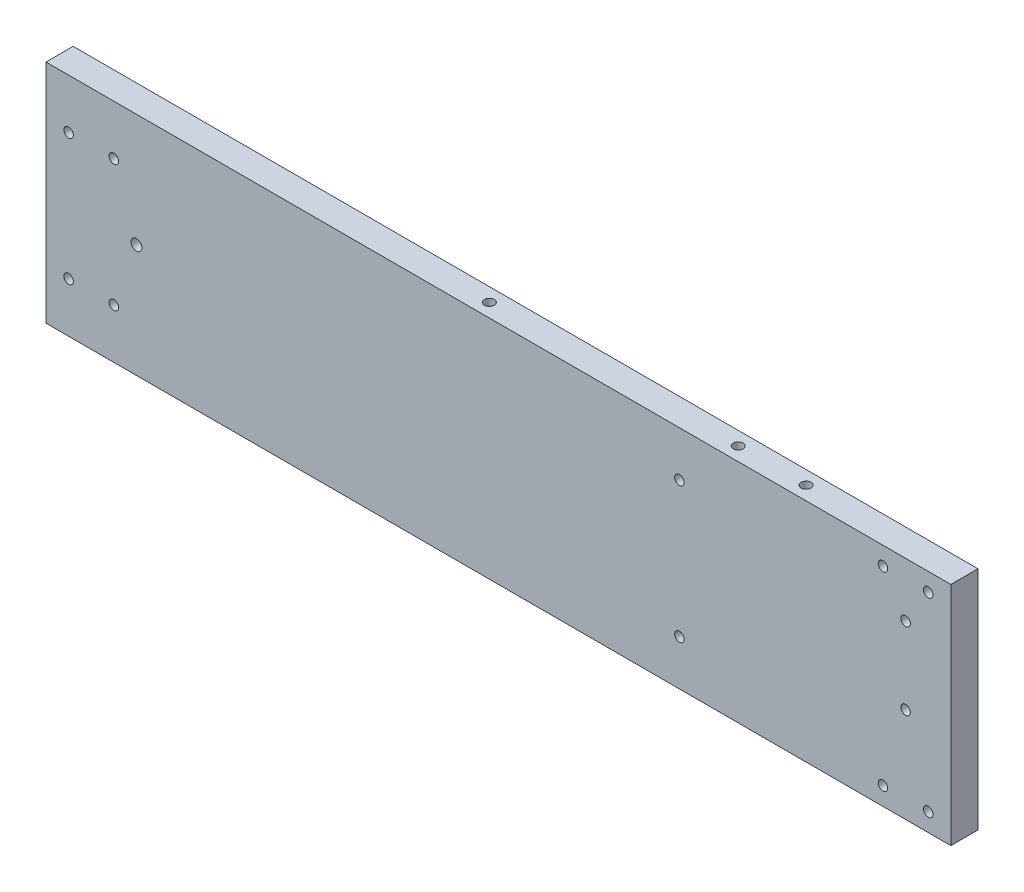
ISO-10303-21;
HEADER;
FILE_DESCRIPTION(('STEP AP214'),'2;1');
FILE_NAME('part.step','',(''),(''),'','','');
FILE_SCHEMA(('AUTOMOTIVE_DESIGN { 1 0 10303 214 1 1 1 1 }'));
ENDSEC;
DATA;
#1=APPLICATION_CONTEXT('core data for automotive mechanical design processes');
#2=APPLICATION_PROTOCOL_DEFINITION('international standard','automotive_design',2000,#1);
#3=PRODUCT_CONTEXT('',#1,'mechanical');
#4=PRODUCT('Part','Part','',(#3));
#5=PRODUCT_RELATED_PRODUCT_CATEGORY('part','',(#4));
#6=PRODUCT_DEFINITION_FORMATION('','',#4);
#7=PRODUCT_DEFINITION_CONTEXT('part definition',#1,'design');
#8=PRODUCT_DEFINITION('design','',#6,#7);
#9=PRODUCT_DEFINITION_SHAPE('','',#8);
#10=(LENGTH_UNIT() NAMED_UNIT(*) SI_UNIT(.MILLI.,.METRE.));
#11=(NAMED_UNIT(*) PLANE_ANGLE_UNIT() SI_UNIT($,.RADIAN.));
#12=(NAMED_UNIT(*) SI_UNIT($,.STERADIAN.) SOLID_ANGLE_UNIT());
#13=UNCERTAINTY_MEASURE_WITH_UNIT(LENGTH_MEASURE(1.E-05),#10,'distance_accuracy_value','');
#14=(GEOMETRIC_REPRESENTATION_CONTEXT(3) GLOBAL_UNCERTAINTY_ASSIGNED_CONTEXT((#13)) GLOBAL_UNIT_ASSIGNED_CONTEXT((#10,
#11,#12)) REPRESENTATION_CONTEXT('',''));
#15=CARTESIAN_POINT('',(0.,0.,0.));
#16=DIRECTION('',(0.,0.,1.));
#17=DIRECTION('',(1.,0.,0.));
#18=AXIS2_PLACEMENT_3D('',#15,#16,#17);
#19=CARTESIAN_POINT('',(-200.,25.,-6.));
#20=DIRECTION('',(-1.,0.,0.));
#21=DIRECTION('',(0.,0.,1.));
#22=AXIS2_PLACEMENT_3D('',#19,#20,#21);
#23=PLANE('',#22);
#24=DIRECTION('',(0.,-1.,0.));
#25=VECTOR('',#24,1.);
#26=CARTESIAN_POINT('',(-200.,25.,0.));
#27=LINE('',#26,#25);
#28=CARTESIAN_POINT('',(-200.,25.,0.));
#29=VERTEX_POINT('',#28);
#30=CARTESIAN_POINT('',(-200.,-25.,0.));
#31=VERTEX_POINT('',#30);
#32=EDGE_CURVE('E71',#29,#31,#27,.T.);
#33=ORIENTED_EDGE('',*,*,#32,.F.);
#34=DIRECTION('',(0.,0.,1.));
#35=VECTOR('',#34,1.);
#36=CARTESIAN_POINT('',(-200.,25.,-6.));
#37=LINE('',#36,#35);
#38=CARTESIAN_POINT('',(-200.,25.,-6.));
#39=VERTEX_POINT('',#38);
#40=EDGE_CURVE('E11',#39,#29,#37,.T.);
#41=ORIENTED_EDGE('',*,*,#40,.F.);
#42=DIRECTION('',(0.,-1.,0.));
#43=VECTOR('',#42,1.);
#44=CARTESIAN_POINT('',(-200.,25.,-6.));
#45=LINE('',#44,#43);
#46=CARTESIAN_POINT('',(-200.,-25.,-6.));
#47=VERTEX_POINT('',#46);
#48=EDGE_CURVE('E73',#39,#47,#45,.T.);
#49=ORIENTED_EDGE('',*,*,#48,.T.);
#50=DIRECTION('',(0.,0.,1.));
#51=VECTOR('',#50,1.);
#52=CARTESIAN_POINT('',(-200.,-25.,-6.));
#53=LINE('',#52,#51);
#54=EDGE_CURVE('E34',#47,#31,#53,.T.);
#55=ORIENTED_EDGE('',*,*,#54,.T.);
#56=EDGE_LOOP('',(#33,#41,#49,#55));
#57=FACE_BOUND('',#56,.T.);
#58=ADVANCED_FACE('F31',(#57),#23,.T.);
#59=CARTESIAN_POINT('',(-200.,25.,-6.));
#60=DIRECTION('',(0.,1.,0.));
#61=DIRECTION('',(0.,0.,1.));
#62=AXIS2_PLACEMENT_3D('',#59,#60,#61);
#63=PLANE('',#62);
#64=CARTESIAN_POINT('',(-50.,25.,-3.));
#65=DIRECTION('',(0.,1.,0.));
#66=DIRECTION('',(0.,0.,1.));
#67=AXIS2_PLACEMENT_3D('',#64,#65,#66);
#68=CIRCLE('',#67,1.10000000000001);
#69=CARTESIAN_POINT('',(-50.,25.,-1.9));
#70=VERTEX_POINT('',#69);
#71=EDGE_CURVE('E141',#70,#70,#68,.T.);
#72=ORIENTED_EDGE('',*,*,#71,.F.);
#73=EDGE_LOOP('',(#72));
#74=FACE_BOUND('',#73,.T.);
#75=CARTESIAN_POINT('',(-105.,25.,-3.));
#76=DIRECTION('',(0.,1.,0.));
#77=DIRECTION('',(0.,0.,1.));
#78=AXIS2_PLACEMENT_3D('',#75,#76,#77);
#79=CIRCLE('',#78,1.10000000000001);
#80=CARTESIAN_POINT('',(-105.,25.,-1.9));
#81=VERTEX_POINT('',#80);
#82=EDGE_CURVE('E145',#81,#81,#79,.T.);
#83=ORIENTED_EDGE('',*,*,#82,.F.);
#84=EDGE_LOOP('',(#83));
#85=FACE_BOUND('',#84,.T.);
#86=CARTESIAN_POINT('',(-35.,25.,-3.));
#87=DIRECTION('',(0.,1.,0.));
#88=DIRECTION('',(0.,0.,1.));
#89=AXIS2_PLACEMENT_3D('',#86,#87,#88);
#90=CIRCLE('',#89,1.1);
#91=CARTESIAN_POINT('',(-35.,25.,-1.9));
#92=VERTEX_POINT('',#91);
#93=EDGE_CURVE('E148',#92,#92,#90,.T.);
#94=ORIENTED_EDGE('',*,*,#93,.F.);
#95=EDGE_LOOP('',(#94));
#96=FACE_BOUND('',#95,.T.);
#97=DIRECTION('',(-1.,0.,0.));
#98=VECTOR('',#97,1.);
#99=CARTESIAN_POINT('',(-200.,25.,0.));
#100=LINE('',#99,#98);
#101=CARTESIAN_POINT('',(0.,25.,0.));
#102=VERTEX_POINT('',#101);
#103=EDGE_CURVE('E88',#102,#29,#100,.T.);
#104=ORIENTED_EDGE('',*,*,#103,.F.);
#105=DIRECTION('',(0.,0.,1.));
#106=VECTOR('',#105,1.);
#107=CARTESIAN_POINT('',(0.,25.,-6.));
#108=LINE('',#107,#106);
#109=CARTESIAN_POINT('',(0.,25.,-6.));
#110=VERTEX_POINT('',#109);
#111=EDGE_CURVE('E39',#110,#102,#108,.T.);
#112=ORIENTED_EDGE('',*,*,#111,.F.);
#113=DIRECTION('',(-1.,0.,0.));
#114=VECTOR('',#113,1.);
#115=CARTESIAN_POINT('',(-200.,25.,-6.));
#116=LINE('',#115,#114);
#117=EDGE_CURVE('E78',#110,#39,#116,.T.);
#118=ORIENTED_EDGE('',*,*,#117,.T.);
#119=ORIENTED_EDGE('',*,*,#40,.T.);
#120=EDGE_LOOP('',(#104,#112,#118,#119));
#121=FACE_BOUND('',#120,.T.);
#122=ADVANCED_FACE('F108',(#74,#85,#96,#121),#63,.T.);
#123=CARTESIAN_POINT('',(0.,25.,-6.));
#124=DIRECTION('',(1.,0.,0.));
#125=DIRECTION('',(0.,0.,-1.));
#126=AXIS2_PLACEMENT_3D('',#123,#124,#125);
#127=PLANE('',#126);
#128=DIRECTION('',(0.,1.,0.));
#129=VECTOR('',#128,1.);
#130=CARTESIAN_POINT('',(0.,25.,0.));
#131=LINE('',#130,#129);
#132=CARTESIAN_POINT('',(0.,-25.,0.));
#133=VERTEX_POINT('',#132);
#134=EDGE_CURVE('E85',#133,#102,#131,.T.);
#135=ORIENTED_EDGE('',*,*,#134,.F.);
#136=DIRECTION('',(0.,0.,1.));
#137=VECTOR('',#136,1.);
#138=CARTESIAN_POINT('',(0.,-25.,-6.));
#139=LINE('',#138,#137);
#140=CARTESIAN_POINT('',(0.,-25.,-6.));
#141=VERTEX_POINT('',#140);
#142=EDGE_CURVE('E77',#141,#133,#139,.T.);
#143=ORIENTED_EDGE('',*,*,#142,.F.);
#144=DIRECTION('',(0.,1.,0.));
#145=VECTOR('',#144,1.);
#146=CARTESIAN_POINT('',(0.,25.,-6.));
#147=LINE('',#146,#145);
#148=EDGE_CURVE('E101',#141,#110,#147,.T.);
#149=ORIENTED_EDGE('',*,*,#148,.T.);
#150=ORIENTED_EDGE('',*,*,#111,.T.);
#151=EDGE_LOOP('',(#135,#143,#149,#150));
#152=FACE_BOUND('',#151,.T.);
#153=ADVANCED_FACE('F105',(#152),#127,.T.);
#154=CARTESIAN_POINT('',(-200.,-25.,-6.));
#155=DIRECTION('',(0.,-1.,0.));
#156=DIRECTION('',(0.,0.,-1.));
#157=AXIS2_PLACEMENT_3D('',#154,#155,#156);
#158=PLANE('',#157);
#159=CARTESIAN_POINT('',(-50.,-25.,-3.2551345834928));
#160=DIRECTION('',(0.,-1.,0.));
#161=DIRECTION('',(0.,0.,-1.));
#162=AXIS2_PLACEMENT_3D('',#159,#160,#161);
#163=CIRCLE('',#162,1.10000000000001);
#164=CARTESIAN_POINT('',(-50.,-25.,-4.35513458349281));
#165=VERTEX_POINT('',#164);
#166=EDGE_CURVE('E154',#165,#165,#163,.T.);
#167=ORIENTED_EDGE('',*,*,#166,.F.);
#168=EDGE_LOOP('',(#167));
#169=FACE_BOUND('',#168,.T.);
#170=CARTESIAN_POINT('',(-105.,-25.,-3.2551345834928));
#171=DIRECTION('',(0.,-1.,0.));
#172=DIRECTION('',(0.,0.,-1.));
#173=AXIS2_PLACEMENT_3D('',#170,#171,#172);
#174=CIRCLE('',#173,1.10000000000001);
#175=CARTESIAN_POINT('',(-105.,-25.,-4.35513458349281));
#176=VERTEX_POINT('',#175);
#177=EDGE_CURVE('E165',#176,#176,#174,.T.);
#178=ORIENTED_EDGE('',*,*,#177,.F.);
#179=EDGE_LOOP('',(#178));
#180=FACE_BOUND('',#179,.T.);
#181=CARTESIAN_POINT('',(-30.,-25.,-3.2551345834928));
#182=DIRECTION('',(0.,-1.,0.));
#183=DIRECTION('',(0.,0.,-1.));
#184=AXIS2_PLACEMENT_3D('',#181,#182,#183);
#185=CIRCLE('',#184,1.1);
#186=CARTESIAN_POINT('',(-30.,-25.,-4.3551345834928));
#187=VERTEX_POINT('',#186);
#188=EDGE_CURVE('E171',#187,#187,#185,.T.);
#189=ORIENTED_EDGE('',*,*,#188,.F.);
#190=EDGE_LOOP('',(#189));
#191=FACE_BOUND('',#190,.T.);
#192=DIRECTION('',(1.,0.,0.));
#193=VECTOR('',#192,1.);
#194=CARTESIAN_POINT('',(-200.,-25.,0.));
#195=LINE('',#194,#193);
#196=EDGE_CURVE('E80',#31,#133,#195,.T.);
#197=ORIENTED_EDGE('',*,*,#196,.F.);
#198=ORIENTED_EDGE('',*,*,#54,.F.);
#199=DIRECTION('',(1.,0.,0.));
#200=VECTOR('',#199,1.);
#201=CARTESIAN_POINT('',(-200.,-25.,-6.));
#202=LINE('',#201,#200);
#203=EDGE_CURVE('E99',#47,#141,#202,.T.);
#204=ORIENTED_EDGE('',*,*,#203,.T.);
#205=ORIENTED_EDGE('',*,*,#142,.T.);
#206=EDGE_LOOP('',(#197,#198,#204,#205));
#207=FACE_BOUND('',#206,.T.);
#208=ADVANCED_FACE('F81',(#169,#180,#191,#207),#158,.T.);
#209=CARTESIAN_POINT('',(-200.,-25.,-6.));
#210=DIRECTION('',(0.,0.,1.));
#211=DIRECTION('',(1.,0.,0.));
#212=AXIS2_PLACEMENT_3D('',#209,#210,#211);
#213=PLANE('',#212);
#214=CARTESIAN_POINT('',(-195.,-14.,-6.));
#215=DIRECTION('',(0.,0.,1.));
#216=DIRECTION('',(-1.,0.,0.));
#217=AXIS2_PLACEMENT_3D('',#214,#215,#216);
#218=CIRCLE('',#217,1.04999999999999);
#219=CARTESIAN_POINT('',(-196.05,-14.,-6.));
#220=VERTEX_POINT('',#219);
#221=EDGE_CURVE('E365',#220,#220,#218,.T.);
#222=ORIENTED_EDGE('',*,*,#221,.T.);
#223=EDGE_LOOP('',(#222));
#224=FACE_BOUND('',#223,.T.);
#225=CARTESIAN_POINT('',(-185.,-14.,-6.));
#226=DIRECTION('',(0.,0.,1.));
#227=DIRECTION('',(-1.,0.,0.));
#228=AXIS2_PLACEMENT_3D('',#225,#226,#227);
#229=CIRCLE('',#228,1.04999999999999);
#230=CARTESIAN_POINT('',(-186.05,-14.,-6.));
#231=VERTEX_POINT('',#230);
#232=EDGE_CURVE('E374',#231,#231,#229,.T.);
#233=ORIENTED_EDGE('',*,*,#232,.T.);
#234=EDGE_LOOP('',(#233));
#235=FACE_BOUND('',#234,.T.);
#236=CARTESIAN_POINT('',(-185.,14.,-6.));
#237=DIRECTION('',(0.,0.,1.));
#238=DIRECTION('',(1.,0.,0.));
#239=AXIS2_PLACEMENT_3D('',#236,#237,#238);
#240=CIRCLE('',#239,1.04999999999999);
#241=CARTESIAN_POINT('',(-183.95,14.,-6.));
#242=VERTEX_POINT('',#241);
#243=EDGE_CURVE('E380',#242,#242,#240,.T.);
#244=ORIENTED_EDGE('',*,*,#243,.T.);
#245=EDGE_LOOP('',(#244));
#246=FACE_BOUND('',#245,.T.);
#247=CARTESIAN_POINT('',(-195.,14.,-6.));
#248=DIRECTION('',(0.,0.,1.));
#249=DIRECTION('',(1.,0.,0.));
#250=AXIS2_PLACEMENT_3D('',#247,#248,#249);
#251=CIRCLE('',#250,1.04999999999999);
#252=CARTESIAN_POINT('',(-193.95,14.,-6.));
#253=VERTEX_POINT('',#252);
#254=EDGE_CURVE('E386',#253,#253,#251,.T.);
#255=ORIENTED_EDGE('',*,*,#254,.T.);
#256=EDGE_LOOP('',(#255));
#257=FACE_BOUND('',#256,.T.);
#258=ORIENTED_EDGE('',*,*,#48,.F.);
#259=ORIENTED_EDGE('',*,*,#117,.F.);
#260=ORIENTED_EDGE('',*,*,#148,.F.);
#261=ORIENTED_EDGE('',*,*,#203,.F.);
#262=EDGE_LOOP('',(#258,#259,#260,#261));
#263=FACE_BOUND('',#262,.T.);
#264=ADVANCED_FACE('F110',(#224,#235,#246,#257,#263),#213,.F.);
#265=CARTESIAN_POINT('',(-200.,-25.,0.));
#266=DIRECTION('',(0.,0.,1.));
#267=DIRECTION('',(1.,0.,0.));
#268=AXIS2_PLACEMENT_3D('',#265,#266,#267);
#269=PLANE('',#268);
#270=CARTESIAN_POINT('',(-180.,0.,0.));
#271=DIRECTION('',(0.,0.,1.));
#272=DIRECTION('',(1.,0.,0.));
#273=AXIS2_PLACEMENT_3D('',#270,#271,#272);
#274=CIRCLE('',#273,1.20000000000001);
#275=CARTESIAN_POINT('',(-178.8,0.,0.));
#276=VERTEX_POINT('',#275);
#277=EDGE_CURVE('E362',#276,#276,#274,.T.);
#278=ORIENTED_EDGE('',*,*,#277,.F.);
#279=EDGE_LOOP('',(#278));
#280=FACE_BOUND('',#279,.T.);
#281=CARTESIAN_POINT('',(-195.,-14.,0.));
#282=DIRECTION('',(0.,0.,1.));
#283=DIRECTION('',(-1.,0.,0.));
#284=AXIS2_PLACEMENT_3D('',#281,#282,#283);
#285=CIRCLE('',#284,1.04999999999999);
#286=CARTESIAN_POINT('',(-196.05,-14.,0.));
#287=VERTEX_POINT('',#286);
#288=EDGE_CURVE('E361',#287,#287,#285,.T.);
#289=ORIENTED_EDGE('',*,*,#288,.F.);
#290=EDGE_LOOP('',(#289));
#291=FACE_BOUND('',#290,.T.);
#292=CARTESIAN_POINT('',(-185.,-14.,0.));
#293=DIRECTION('',(0.,0.,1.));
#294=DIRECTION('',(-1.,0.,0.));
#295=AXIS2_PLACEMENT_3D('',#292,#293,#294);
#296=CIRCLE('',#295,1.04999999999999);
#297=CARTESIAN_POINT('',(-186.05,-14.,0.));
#298=VERTEX_POINT('',#297);
#299=EDGE_CURVE('E371',#298,#298,#296,.T.);
#300=ORIENTED_EDGE('',*,*,#299,.F.);
#301=EDGE_LOOP('',(#300));
#302=FACE_BOUND('',#301,.T.);
#303=CARTESIAN_POINT('',(-185.,14.,0.));
#304=DIRECTION('',(0.,0.,1.));
#305=DIRECTION('',(1.,0.,0.));
#306=AXIS2_PLACEMENT_3D('',#303,#304,#305);
#307=CIRCLE('',#306,1.04999999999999);
#308=CARTESIAN_POINT('',(-183.95,14.,0.));
#309=VERTEX_POINT('',#308);
#310=EDGE_CURVE('E377',#309,#309,#307,.T.);
#311=ORIENTED_EDGE('',*,*,#310,.F.);
#312=EDGE_LOOP('',(#311));
#313=FACE_BOUND('',#312,.T.);
#314=CARTESIAN_POINT('',(-195.,14.,0.));
#315=DIRECTION('',(0.,0.,1.));
#316=DIRECTION('',(1.,0.,0.));
#317=AXIS2_PLACEMENT_3D('',#314,#315,#316);
#318=CIRCLE('',#317,1.04999999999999);
#319=CARTESIAN_POINT('',(-193.95,14.,0.));
#320=VERTEX_POINT('',#319);
#321=EDGE_CURVE('E383',#320,#320,#318,.T.);
#322=ORIENTED_EDGE('',*,*,#321,.F.);
#323=EDGE_LOOP('',(#322));
#324=FACE_BOUND('',#323,.T.);
#325=CARTESIAN_POINT('',(-10.,-4.,0.));
#326=DIRECTION('',(0.,0.,1.));
#327=DIRECTION('',(1.,0.,0.));
#328=AXIS2_PLACEMENT_3D('',#325,#326,#327);
#329=CIRCLE('',#328,1.05);
#330=CARTESIAN_POINT('',(-8.95,-4.,0.));
#331=VERTEX_POINT('',#330);
#332=EDGE_CURVE('E177',#331,#331,#329,.T.);
#333=ORIENTED_EDGE('',*,*,#332,.F.);
#334=EDGE_LOOP('',(#333));
#335=FACE_BOUND('',#334,.T.);
#336=CARTESIAN_POINT('',(-10.,13.,0.));
#337=DIRECTION('',(0.,0.,1.));
#338=DIRECTION('',(1.,0.,0.));
#339=AXIS2_PLACEMENT_3D('',#336,#337,#338);
#340=CIRCLE('',#339,1.05);
#341=CARTESIAN_POINT('',(-8.95,13.,0.));
#342=VERTEX_POINT('',#341);
#343=EDGE_CURVE('E183',#342,#342,#340,.T.);
#344=ORIENTED_EDGE('',*,*,#343,.F.);
#345=EDGE_LOOP('',(#344));
#346=FACE_BOUND('',#345,.T.);
#347=CARTESIAN_POINT('',(-60.,-15.,0.));
#348=DIRECTION('',(0.,0.,1.));
#349=DIRECTION('',(1.,0.,0.));
#350=AXIS2_PLACEMENT_3D('',#347,#348,#349);
#351=CIRCLE('',#350,1.04999999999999);
#352=CARTESIAN_POINT('',(-58.95,-15.,0.));
#353=VERTEX_POINT('',#352);
#354=EDGE_CURVE('E189',#353,#353,#351,.T.);
#355=ORIENTED_EDGE('',*,*,#354,.F.);
#356=EDGE_LOOP('',(#355));
#357=FACE_BOUND('',#356,.T.);
#358=CARTESIAN_POINT('',(-60.,15.,0.));
#359=DIRECTION('',(0.,0.,1.));
#360=DIRECTION('',(1.,0.,0.));
#361=AXIS2_PLACEMENT_3D('',#358,#359,#360);
#362=CIRCLE('',#361,1.05);
#363=CARTESIAN_POINT('',(-58.95,15.,0.));
#364=VERTEX_POINT('',#363);
#365=EDGE_CURVE('E195',#364,#364,#362,.T.);
#366=ORIENTED_EDGE('',*,*,#365,.F.);
#367=EDGE_LOOP('',(#366));
#368=FACE_BOUND('',#367,.T.);
#369=CARTESIAN_POINT('',(-15.,-21.,0.));
#370=DIRECTION('',(0.,0.,1.));
#371=DIRECTION('',(-1.,0.,0.));
#372=AXIS2_PLACEMENT_3D('',#369,#370,#371);
#373=CIRCLE('',#372,1.05);
#374=CARTESIAN_POINT('',(-16.05,-21.,0.));
#375=VERTEX_POINT('',#374);
#376=EDGE_CURVE('E201',#375,#375,#373,.T.);
#377=ORIENTED_EDGE('',*,*,#376,.F.);
#378=EDGE_LOOP('',(#377));
#379=FACE_BOUND('',#378,.T.);
#380=CARTESIAN_POINT('',(-5.,-21.,0.));
#381=DIRECTION('',(0.,0.,1.));
#382=DIRECTION('',(-1.,0.,0.));
#383=AXIS2_PLACEMENT_3D('',#380,#381,#382);
#384=CIRCLE('',#383,1.05);
#385=CARTESIAN_POINT('',(-6.05,-21.,0.));
#386=VERTEX_POINT('',#385);
#387=EDGE_CURVE('E207',#386,#386,#384,.T.);
#388=ORIENTED_EDGE('',*,*,#387,.F.);
#389=EDGE_LOOP('',(#388));
#390=FACE_BOUND('',#389,.T.);
#391=CARTESIAN_POINT('',(-15.,21.,0.));
#392=DIRECTION('',(0.,0.,1.));
#393=DIRECTION('',(1.,0.,0.));
#394=AXIS2_PLACEMENT_3D('',#391,#392,#393);
#395=CIRCLE('',#394,1.05);
#396=CARTESIAN_POINT('',(-13.95,21.,0.));
#397=VERTEX_POINT('',#396);
#398=EDGE_CURVE('E213',#397,#397,#395,.T.);
#399=ORIENTED_EDGE('',*,*,#398,.F.);
#400=EDGE_LOOP('',(#399));
#401=FACE_BOUND('',#400,.T.);
#402=CARTESIAN_POINT('',(-5.,21.,0.));
#403=DIRECTION('',(0.,0.,1.));
#404=DIRECTION('',(1.,0.,0.));
#405=AXIS2_PLACEMENT_3D('',#402,#403,#404);
#406=CIRCLE('',#405,1.05);
#407=CARTESIAN_POINT('',(-3.95,21.,0.));
#408=VERTEX_POINT('',#407);
#409=EDGE_CURVE('E92',#408,#408,#406,.T.);
#410=ORIENTED_EDGE('',*,*,#409,.F.);
#411=EDGE_LOOP('',(#410));
#412=FACE_BOUND('',#411,.T.);
#413=ORIENTED_EDGE('',*,*,#32,.T.);
#414=ORIENTED_EDGE('',*,*,#196,.T.);
#415=ORIENTED_EDGE('',*,*,#134,.T.);
#416=ORIENTED_EDGE('',*,*,#103,.T.);
#417=EDGE_LOOP('',(#413,#414,#415,#416));
#418=FACE_BOUND('',#417,.T.);
#419=ADVANCED_FACE('F87',(#280,#291,#302,#313,#324,#335,#346,#357,#368,#379,#390,#401,#412,
#418),#269,.T.);
#420=CARTESIAN_POINT('',(-5.,21.,-2.));
#421=DIRECTION('',(0.,0.,1.));
#422=DIRECTION('',(1.,0.,0.));
#423=AXIS2_PLACEMENT_3D('',#420,#421,#422);
#424=CYLINDRICAL_SURFACE('',#423,1.05);
#425=CARTESIAN_POINT('',(-5.,21.,-2.));
#426=DIRECTION('',(0.,0.,1.));
#427=DIRECTION('',(1.,0.,0.));
#428=AXIS2_PLACEMENT_3D('',#425,#426,#427);
#429=CIRCLE('',#428,1.05);
#430=CARTESIAN_POINT('',(-3.95,21.,-2.));
#431=VERTEX_POINT('',#430);
#432=EDGE_CURVE('E89',#431,#431,#429,.T.);
#433=ORIENTED_EDGE('',*,*,#432,.F.);
#434=EDGE_LOOP('',(#433));
#435=FACE_BOUND('',#434,.T.);
#436=ORIENTED_EDGE('',*,*,#409,.T.);
#437=EDGE_LOOP('',(#436));
#438=FACE_BOUND('',#437,.T.);
#439=ADVANCED_FACE('F119',(#435,#438),#424,.F.);
#440=CARTESIAN_POINT('',(-5.,21.,-2.));
#441=DIRECTION('',(0.,0.,1.));
#442=DIRECTION('',(1.,0.,0.));
#443=AXIS2_PLACEMENT_3D('',#440,#441,#442);
#444=PLANE('',#443);
#445=ORIENTED_EDGE('',*,*,#432,.T.);
#446=EDGE_LOOP('',(#445));
#447=FACE_BOUND('',#446,.T.);
#448=ADVANCED_FACE('F223',(#447),#444,.T.);
#449=CARTESIAN_POINT('',(-15.,21.,-2.));
#450=DIRECTION('',(0.,0.,1.));
#451=DIRECTION('',(1.,0.,0.));
#452=AXIS2_PLACEMENT_3D('',#449,#450,#451);
#453=CYLINDRICAL_SURFACE('',#452,1.05);
#454=CARTESIAN_POINT('',(-15.,21.,-2.));
#455=DIRECTION('',(0.,0.,1.));
#456=DIRECTION('',(1.,0.,0.));
#457=AXIS2_PLACEMENT_3D('',#454,#455,#456);
#458=CIRCLE('',#457,1.05);
#459=CARTESIAN_POINT('',(-13.95,21.,-2.));
#460=VERTEX_POINT('',#459);
#461=EDGE_CURVE('E216',#460,#460,#458,.T.);
#462=ORIENTED_EDGE('',*,*,#461,.F.);
#463=EDGE_LOOP('',(#462));
#464=FACE_BOUND('',#463,.T.);
#465=ORIENTED_EDGE('',*,*,#398,.T.);
#466=EDGE_LOOP('',(#465));
#467=FACE_BOUND('',#466,.T.);
#468=ADVANCED_FACE('F229',(#464,#467),#453,.F.);
#469=CARTESIAN_POINT('',(-15.,21.,-2.));
#470=DIRECTION('',(0.,0.,1.));
#471=DIRECTION('',(1.,0.,0.));
#472=AXIS2_PLACEMENT_3D('',#469,#470,#471);
#473=PLANE('',#472);
#474=ORIENTED_EDGE('',*,*,#461,.T.);
#475=EDGE_LOOP('',(#474));
#476=FACE_BOUND('',#475,.T.);
#477=ADVANCED_FACE('F236',(#476),#473,.T.);
#478=CARTESIAN_POINT('',(-5.,-21.,-2.));
#479=DIRECTION('',(0.,0.,1.));
#480=DIRECTION('',(1.,0.,0.));
#481=AXIS2_PLACEMENT_3D('',#478,#479,#480);
#482=CYLINDRICAL_SURFACE('',#481,1.05);
#483=CARTESIAN_POINT('',(-5.,-21.,-2.));
#484=DIRECTION('',(0.,0.,1.));
#485=DIRECTION('',(-1.,0.,0.));
#486=AXIS2_PLACEMENT_3D('',#483,#484,#485);
#487=CIRCLE('',#486,1.05);
#488=CARTESIAN_POINT('',(-6.05,-21.,-2.));
#489=VERTEX_POINT('',#488);
#490=EDGE_CURVE('E210',#489,#489,#487,.T.);
#491=ORIENTED_EDGE('',*,*,#490,.F.);
#492=EDGE_LOOP('',(#491));
#493=FACE_BOUND('',#492,.T.);
#494=ORIENTED_EDGE('',*,*,#387,.T.);
#495=EDGE_LOOP('',(#494));
#496=FACE_BOUND('',#495,.T.);
#497=ADVANCED_FACE('F240',(#493,#496),#482,.F.);
#498=CARTESIAN_POINT('',(-5.,-21.,-2.));
#499=DIRECTION('',(0.,0.,-1.));
#500=DIRECTION('',(-1.,0.,0.));
#501=AXIS2_PLACEMENT_3D('',#498,#499,#500);
#502=PLANE('',#501);
#503=ORIENTED_EDGE('',*,*,#490,.T.);
#504=EDGE_LOOP('',(#503));
#505=FACE_BOUND('',#504,.T.);
#506=ADVANCED_FACE('F244',(#505),#502,.F.);
#507=CARTESIAN_POINT('',(-15.,-21.,-2.));
#508=DIRECTION('',(0.,0.,1.));
#509=DIRECTION('',(1.,0.,0.));
#510=AXIS2_PLACEMENT_3D('',#507,#508,#509);
#511=CYLINDRICAL_SURFACE('',#510,1.05);
#512=CARTESIAN_POINT('',(-15.,-21.,-2.));
#513=DIRECTION('',(0.,0.,1.));
#514=DIRECTION('',(-1.,0.,0.));
#515=AXIS2_PLACEMENT_3D('',#512,#513,#514);
#516=CIRCLE('',#515,1.05);
#517=CARTESIAN_POINT('',(-16.05,-21.,-2.));
#518=VERTEX_POINT('',#517);
#519=EDGE_CURVE('E204',#518,#518,#516,.T.);
#520=ORIENTED_EDGE('',*,*,#519,.F.);
#521=EDGE_LOOP('',(#520));
#522=FACE_BOUND('',#521,.T.);
#523=ORIENTED_EDGE('',*,*,#376,.T.);
#524=EDGE_LOOP('',(#523));
#525=FACE_BOUND('',#524,.T.);
#526=ADVANCED_FACE('F248',(#522,#525),#511,.F.);
#527=CARTESIAN_POINT('',(-15.,-21.,-2.));
#528=DIRECTION('',(0.,0.,-1.));
#529=DIRECTION('',(-1.,0.,0.));
#530=AXIS2_PLACEMENT_3D('',#527,#528,#529);
#531=PLANE('',#530);
#532=ORIENTED_EDGE('',*,*,#519,.T.);
#533=EDGE_LOOP('',(#532));
#534=FACE_BOUND('',#533,.T.);
#535=ADVANCED_FACE('F252',(#534),#531,.F.);
#536=CARTESIAN_POINT('',(-60.,15.,-2.));
#537=DIRECTION('',(0.,0.,1.));
#538=DIRECTION('',(1.,0.,0.));
#539=AXIS2_PLACEMENT_3D('',#536,#537,#538);
#540=CYLINDRICAL_SURFACE('',#539,1.05);
#541=CARTESIAN_POINT('',(-60.,15.,-2.));
#542=DIRECTION('',(0.,0.,1.));
#543=DIRECTION('',(1.,0.,0.));
#544=AXIS2_PLACEMENT_3D('',#541,#542,#543);
#545=CIRCLE('',#544,1.05);
#546=CARTESIAN_POINT('',(-58.95,15.,-2.));
#547=VERTEX_POINT('',#546);
#548=EDGE_CURVE('E198',#547,#547,#545,.T.);
#549=ORIENTED_EDGE('',*,*,#548,.F.);
#550=EDGE_LOOP('',(#549));
#551=FACE_BOUND('',#550,.T.);
#552=ORIENTED_EDGE('',*,*,#365,.T.);
#553=EDGE_LOOP('',(#552));
#554=FACE_BOUND('',#553,.T.);
#555=ADVANCED_FACE('F256',(#551,#554),#540,.F.);
#556=CARTESIAN_POINT('',(-60.,15.,-2.));
#557=DIRECTION('',(0.,0.,1.));
#558=DIRECTION('',(1.,0.,0.));
#559=AXIS2_PLACEMENT_3D('',#556,#557,#558);
#560=PLANE('',#559);
#561=ORIENTED_EDGE('',*,*,#548,.T.);
#562=EDGE_LOOP('',(#561));
#563=FACE_BOUND('',#562,.T.);
#564=ADVANCED_FACE('F260',(#563),#560,.T.);
#565=CARTESIAN_POINT('',(-60.,-15.,-2.));
#566=DIRECTION('',(0.,0.,1.));
#567=DIRECTION('',(1.,0.,0.));
#568=AXIS2_PLACEMENT_3D('',#565,#566,#567);
#569=CYLINDRICAL_SURFACE('',#568,1.04999999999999);
#570=CARTESIAN_POINT('',(-60.,-15.,-2.));
#571=DIRECTION('',(0.,0.,1.));
#572=DIRECTION('',(1.,0.,0.));
#573=AXIS2_PLACEMENT_3D('',#570,#571,#572);
#574=CIRCLE('',#573,1.04999999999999);
#575=CARTESIAN_POINT('',(-58.95,-15.,-2.));
#576=VERTEX_POINT('',#575);
#577=EDGE_CURVE('E192',#576,#576,#574,.T.);
#578=ORIENTED_EDGE('',*,*,#577,.F.);
#579=EDGE_LOOP('',(#578));
#580=FACE_BOUND('',#579,.T.);
#581=ORIENTED_EDGE('',*,*,#354,.T.);
#582=EDGE_LOOP('',(#581));
#583=FACE_BOUND('',#582,.T.);
#584=ADVANCED_FACE('F264',(#580,#583),#569,.F.);
#585=CARTESIAN_POINT('',(-60.,-15.,-2.));
#586=DIRECTION('',(0.,0.,1.));
#587=DIRECTION('',(1.,0.,0.));
#588=AXIS2_PLACEMENT_3D('',#585,#586,#587);
#589=PLANE('',#588);
#590=ORIENTED_EDGE('',*,*,#577,.T.);
#591=EDGE_LOOP('',(#590));
#592=FACE_BOUND('',#591,.T.);
#593=ADVANCED_FACE('F268',(#592),#589,.T.);
#594=CARTESIAN_POINT('',(-10.,13.,-2.));
#595=DIRECTION('',(0.,0.,1.));
#596=DIRECTION('',(1.,0.,0.));
#597=AXIS2_PLACEMENT_3D('',#594,#595,#596);
#598=CYLINDRICAL_SURFACE('',#597,1.05);
#599=CARTESIAN_POINT('',(-10.,13.,-2.));
#600=DIRECTION('',(0.,0.,1.));
#601=DIRECTION('',(1.,0.,0.));
#602=AXIS2_PLACEMENT_3D('',#599,#600,#601);
#603=CIRCLE('',#602,1.05);
#604=CARTESIAN_POINT('',(-8.95,13.,-2.));
#605=VERTEX_POINT('',#604);
#606=EDGE_CURVE('E186',#605,#605,#603,.T.);
#607=ORIENTED_EDGE('',*,*,#606,.F.);
#608=EDGE_LOOP('',(#607));
#609=FACE_BOUND('',#608,.T.);
#610=ORIENTED_EDGE('',*,*,#343,.T.);
#611=EDGE_LOOP('',(#610));
#612=FACE_BOUND('',#611,.T.);
#613=ADVANCED_FACE('F272',(#609,#612),#598,.F.);
#614=CARTESIAN_POINT('',(-10.,13.,-2.));
#615=DIRECTION('',(0.,0.,1.));
#616=DIRECTION('',(1.,0.,0.));
#617=AXIS2_PLACEMENT_3D('',#614,#615,#616);
#618=PLANE('',#617);
#619=ORIENTED_EDGE('',*,*,#606,.T.);
#620=EDGE_LOOP('',(#619));
#621=FACE_BOUND('',#620,.T.);
#622=ADVANCED_FACE('F276',(#621),#618,.T.);
#623=CARTESIAN_POINT('',(-10.,-4.,-2.));
#624=DIRECTION('',(0.,0.,1.));
#625=DIRECTION('',(1.,0.,0.));
#626=AXIS2_PLACEMENT_3D('',#623,#624,#625);
#627=CYLINDRICAL_SURFACE('',#626,1.05);
#628=CARTESIAN_POINT('',(-10.,-4.,-2.));
#629=DIRECTION('',(0.,0.,1.));
#630=DIRECTION('',(1.,0.,0.));
#631=AXIS2_PLACEMENT_3D('',#628,#629,#630);
#632=CIRCLE('',#631,1.05);
#633=CARTESIAN_POINT('',(-8.95,-4.,-2.));
#634=VERTEX_POINT('',#633);
#635=EDGE_CURVE('E180',#634,#634,#632,.T.);
#636=ORIENTED_EDGE('',*,*,#635,.F.);
#637=EDGE_LOOP('',(#636));
#638=FACE_BOUND('',#637,.T.);
#639=ORIENTED_EDGE('',*,*,#332,.T.);
#640=EDGE_LOOP('',(#639));
#641=FACE_BOUND('',#640,.T.);
#642=ADVANCED_FACE('F280',(#638,#641),#627,.F.);
#643=CARTESIAN_POINT('',(-10.,-4.,-2.));
#644=DIRECTION('',(0.,0.,1.));
#645=DIRECTION('',(1.,0.,0.));
#646=AXIS2_PLACEMENT_3D('',#643,#644,#645);
#647=PLANE('',#646);
#648=ORIENTED_EDGE('',*,*,#635,.T.);
#649=EDGE_LOOP('',(#648));
#650=FACE_BOUND('',#649,.T.);
#651=ADVANCED_FACE('F284',(#650),#647,.T.);
#652=CARTESIAN_POINT('',(-30.,-22.,-3.2551345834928));
#653=DIRECTION('',(0.,-1.,0.));
#654=DIRECTION('',(0.,0.,-1.));
#655=AXIS2_PLACEMENT_3D('',#652,#653,#654);
#656=CYLINDRICAL_SURFACE('',#655,1.1);
#657=CARTESIAN_POINT('',(-30.,-22.,-3.2551345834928));
#658=DIRECTION('',(0.,-1.,0.));
#659=DIRECTION('',(0.,0.,-1.));
#660=AXIS2_PLACEMENT_3D('',#657,#658,#659);
#661=CIRCLE('',#660,1.1);
#662=CARTESIAN_POINT('',(-30.,-22.,-4.3551345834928));
#663=VERTEX_POINT('',#662);
#664=EDGE_CURVE('E174',#663,#663,#661,.T.);
#665=ORIENTED_EDGE('',*,*,#664,.F.);
#666=EDGE_LOOP('',(#665));
#667=FACE_BOUND('',#666,.T.);
#668=ORIENTED_EDGE('',*,*,#188,.T.);
#669=EDGE_LOOP('',(#668));
#670=FACE_BOUND('',#669,.T.);
#671=ADVANCED_FACE('F288',(#667,#670),#656,.F.);
#672=CARTESIAN_POINT('',(-30.,-22.,-3.2551345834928));
#673=DIRECTION('',(0.,-1.,0.));
#674=DIRECTION('',(0.,0.,-1.));
#675=AXIS2_PLACEMENT_3D('',#672,#673,#674);
#676=PLANE('',#675);
#677=ORIENTED_EDGE('',*,*,#664,.T.);
#678=EDGE_LOOP('',(#677));
#679=FACE_BOUND('',#678,.T.);
#680=ADVANCED_FACE('F292',(#679),#676,.T.);
#681=CARTESIAN_POINT('',(-105.,-22.,-3.2551345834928));
#682=DIRECTION('',(0.,-1.,0.));
#683=DIRECTION('',(0.,0.,-1.));
#684=AXIS2_PLACEMENT_3D('',#681,#682,#683);
#685=CYLINDRICAL_SURFACE('',#684,1.10000000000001);
#686=CARTESIAN_POINT('',(-105.,-22.,-3.2551345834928));
#687=DIRECTION('',(0.,-1.,0.));
#688=DIRECTION('',(0.,0.,-1.));
#689=AXIS2_PLACEMENT_3D('',#686,#687,#688);
#690=CIRCLE('',#689,1.10000000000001);
#691=CARTESIAN_POINT('',(-105.,-22.,-4.35513458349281));
#692=VERTEX_POINT('',#691);
#693=EDGE_CURVE('E168',#692,#692,#690,.T.);
#694=ORIENTED_EDGE('',*,*,#693,.F.);
#695=EDGE_LOOP('',(#694));
#696=FACE_BOUND('',#695,.T.);
#697=ORIENTED_EDGE('',*,*,#177,.T.);
#698=EDGE_LOOP('',(#697));
#699=FACE_BOUND('',#698,.T.);
#700=ADVANCED_FACE('F296',(#696,#699),#685,.F.);
#701=CARTESIAN_POINT('',(-105.,-22.,-3.2551345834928));
#702=DIRECTION('',(0.,-1.,0.));
#703=DIRECTION('',(0.,0.,-1.));
#704=AXIS2_PLACEMENT_3D('',#701,#702,#703);
#705=PLANE('',#704);
#706=ORIENTED_EDGE('',*,*,#693,.T.);
#707=EDGE_LOOP('',(#706));
#708=FACE_BOUND('',#707,.T.);
#709=ADVANCED_FACE('F300',(#708),#705,.T.);
#710=CARTESIAN_POINT('',(-50.,-22.,-3.2551345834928));
#711=DIRECTION('',(0.,-1.,0.));
#712=DIRECTION('',(0.,0.,-1.));
#713=AXIS2_PLACEMENT_3D('',#710,#711,#712);
#714=CYLINDRICAL_SURFACE('',#713,1.10000000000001);
#715=CARTESIAN_POINT('',(-50.,-22.,-3.2551345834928));
#716=DIRECTION('',(0.,-1.,0.));
#717=DIRECTION('',(0.,0.,-1.));
#718=AXIS2_PLACEMENT_3D('',#715,#716,#717);
#719=CIRCLE('',#718,1.10000000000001);
#720=CARTESIAN_POINT('',(-50.,-22.,-4.35513458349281));
#721=VERTEX_POINT('',#720);
#722=EDGE_CURVE('E162',#721,#721,#719,.T.);
#723=ORIENTED_EDGE('',*,*,#722,.F.);
#724=EDGE_LOOP('',(#723));
#725=FACE_BOUND('',#724,.T.);
#726=ORIENTED_EDGE('',*,*,#166,.T.);
#727=EDGE_LOOP('',(#726));
#728=FACE_BOUND('',#727,.T.);
#729=ADVANCED_FACE('F304',(#725,#728),#714,.F.);
#730=CARTESIAN_POINT('',(-50.,-22.,-3.2551345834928));
#731=DIRECTION('',(0.,-1.,0.));
#732=DIRECTION('',(0.,0.,-1.));
#733=AXIS2_PLACEMENT_3D('',#730,#731,#732);
#734=PLANE('',#733);
#735=ORIENTED_EDGE('',*,*,#722,.T.);
#736=EDGE_LOOP('',(#735));
#737=FACE_BOUND('',#736,.T.);
#738=ADVANCED_FACE('F308',(#737),#734,.T.);
#739=CARTESIAN_POINT('',(-35.,22.,-3.));
#740=DIRECTION('',(0.,1.,0.));
#741=DIRECTION('',(0.,0.,1.));
#742=AXIS2_PLACEMENT_3D('',#739,#740,#741);
#743=CYLINDRICAL_SURFACE('',#742,1.1);
#744=CARTESIAN_POINT('',(-35.,22.,-3.));
#745=DIRECTION('',(0.,1.,0.));
#746=DIRECTION('',(0.,0.,1.));
#747=AXIS2_PLACEMENT_3D('',#744,#745,#746);
#748=CIRCLE('',#747,1.1);
#749=CARTESIAN_POINT('',(-35.,22.,-1.9));
#750=VERTEX_POINT('',#749);
#751=EDGE_CURVE('E150',#750,#750,#748,.T.);
#752=ORIENTED_EDGE('',*,*,#751,.F.);
#753=EDGE_LOOP('',(#752));
#754=FACE_BOUND('',#753,.T.);
#755=ORIENTED_EDGE('',*,*,#93,.T.);
#756=EDGE_LOOP('',(#755));
#757=FACE_BOUND('',#756,.T.);
#758=ADVANCED_FACE('F311',(#754,#757),#743,.F.);
#759=CARTESIAN_POINT('',(-35.,22.,-3.));
#760=DIRECTION('',(0.,1.,0.));
#761=DIRECTION('',(0.,0.,1.));
#762=AXIS2_PLACEMENT_3D('',#759,#760,#761);
#763=PLANE('',#762);
#764=ORIENTED_EDGE('',*,*,#751,.T.);
#765=EDGE_LOOP('',(#764));
#766=FACE_BOUND('',#765,.T.);
#767=ADVANCED_FACE('F314',(#766),#763,.T.);
#768=CARTESIAN_POINT('',(-105.,22.,-3.));
#769=DIRECTION('',(0.,1.,0.));
#770=DIRECTION('',(0.,0.,1.));
#771=AXIS2_PLACEMENT_3D('',#768,#769,#770);
#772=CYLINDRICAL_SURFACE('',#771,1.10000000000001);
#773=CARTESIAN_POINT('',(-105.,22.,-3.));
#774=DIRECTION('',(0.,1.,0.));
#775=DIRECTION('',(0.,0.,1.));
#776=AXIS2_PLACEMENT_3D('',#773,#774,#775);
#777=CIRCLE('',#776,1.10000000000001);
#778=CARTESIAN_POINT('',(-105.,22.,-1.9));
#779=VERTEX_POINT('',#778);
#780=EDGE_CURVE('E151',#779,#779,#777,.T.);
#781=ORIENTED_EDGE('',*,*,#780,.F.);
#782=EDGE_LOOP('',(#781));
#783=FACE_BOUND('',#782,.T.);
#784=ORIENTED_EDGE('',*,*,#82,.T.);
#785=EDGE_LOOP('',(#784));
#786=FACE_BOUND('',#785,.T.);
#787=ADVANCED_FACE('F318',(#783,#786),#772,.F.);
#788=CARTESIAN_POINT('',(-105.,22.,-3.));
#789=DIRECTION('',(0.,1.,0.));
#790=DIRECTION('',(0.,0.,1.));
#791=AXIS2_PLACEMENT_3D('',#788,#789,#790);
#792=PLANE('',#791);
#793=ORIENTED_EDGE('',*,*,#780,.T.);
#794=EDGE_LOOP('',(#793));
#795=FACE_BOUND('',#794,.T.);
#796=ADVANCED_FACE('F322',(#795),#792,.T.);
#797=CARTESIAN_POINT('',(-50.,22.,-3.));
#798=DIRECTION('',(0.,1.,0.));
#799=DIRECTION('',(0.,0.,1.));
#800=AXIS2_PLACEMENT_3D('',#797,#798,#799);
#801=CYLINDRICAL_SURFACE('',#800,1.10000000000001);
#802=CARTESIAN_POINT('',(-50.,22.,-3.));
#803=DIRECTION('',(0.,1.,0.));
#804=DIRECTION('',(0.,0.,1.));
#805=AXIS2_PLACEMENT_3D('',#802,#803,#804);
#806=CIRCLE('',#805,1.10000000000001);
#807=CARTESIAN_POINT('',(-50.,22.,-1.9));
#808=VERTEX_POINT('',#807);
#809=EDGE_CURVE('E390',#808,#808,#806,.T.);
#810=ORIENTED_EDGE('',*,*,#809,.F.);
#811=EDGE_LOOP('',(#810));
#812=FACE_BOUND('',#811,.T.);
#813=ORIENTED_EDGE('',*,*,#71,.T.);
#814=EDGE_LOOP('',(#813));
#815=FACE_BOUND('',#814,.T.);
#816=ADVANCED_FACE('F326',(#812,#815),#801,.F.);
#817=CARTESIAN_POINT('',(-50.,22.,-3.));
#818=DIRECTION('',(0.,1.,0.));
#819=DIRECTION('',(0.,0.,1.));
#820=AXIS2_PLACEMENT_3D('',#817,#818,#819);
#821=PLANE('',#820);
#822=ORIENTED_EDGE('',*,*,#809,.T.);
#823=EDGE_LOOP('',(#822));
#824=FACE_BOUND('',#823,.T.);
#825=ADVANCED_FACE('F330',(#824),#821,.T.);
#826=CARTESIAN_POINT('',(-195.,14.,-6.));
#827=DIRECTION('',(0.,0.,1.));
#828=DIRECTION('',(1.,0.,0.));
#829=AXIS2_PLACEMENT_3D('',#826,#827,#828);
#830=CYLINDRICAL_SURFACE('',#829,1.04999999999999);
#831=ORIENTED_EDGE('',*,*,#254,.F.);
#832=EDGE_LOOP('',(#831));
#833=FACE_BOUND('',#832,.T.);
#834=ORIENTED_EDGE('',*,*,#321,.T.);
#835=EDGE_LOOP('',(#834));
#836=FACE_BOUND('',#835,.T.);
#837=ADVANCED_FACE('F333',(#833,#836),#830,.F.);
#838=CARTESIAN_POINT('',(-185.,14.,-6.));
#839=DIRECTION('',(0.,0.,1.));
#840=DIRECTION('',(1.,0.,0.));
#841=AXIS2_PLACEMENT_3D('',#838,#839,#840);
#842=CYLINDRICAL_SURFACE('',#841,1.04999999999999);
#843=ORIENTED_EDGE('',*,*,#243,.F.);
#844=EDGE_LOOP('',(#843));
#845=FACE_BOUND('',#844,.T.);
#846=ORIENTED_EDGE('',*,*,#310,.T.);
#847=EDGE_LOOP('',(#846));
#848=FACE_BOUND('',#847,.T.);
#849=ADVANCED_FACE('F336',(#845,#848),#842,.F.);
#850=CARTESIAN_POINT('',(-185.,-14.,-6.));
#851=DIRECTION('',(0.,0.,1.));
#852=DIRECTION('',(1.,0.,0.));
#853=AXIS2_PLACEMENT_3D('',#850,#851,#852);
#854=CYLINDRICAL_SURFACE('',#853,1.04999999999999);
#855=ORIENTED_EDGE('',*,*,#232,.F.);
#856=EDGE_LOOP('',(#855));
#857=FACE_BOUND('',#856,.T.);
#858=ORIENTED_EDGE('',*,*,#299,.T.);
#859=EDGE_LOOP('',(#858));
#860=FACE_BOUND('',#859,.T.);
#861=ADVANCED_FACE('F340',(#857,#860),#854,.F.);
#862=CARTESIAN_POINT('',(-195.,-14.,-6.));
#863=DIRECTION('',(0.,0.,1.));
#864=DIRECTION('',(1.,0.,0.));
#865=AXIS2_PLACEMENT_3D('',#862,#863,#864);
#866=CYLINDRICAL_SURFACE('',#865,1.04999999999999);
#867=ORIENTED_EDGE('',*,*,#221,.F.);
#868=EDGE_LOOP('',(#867));
#869=FACE_BOUND('',#868,.T.);
#870=ORIENTED_EDGE('',*,*,#288,.T.);
#871=EDGE_LOOP('',(#870));
#872=FACE_BOUND('',#871,.T.);
#873=ADVANCED_FACE('F344',(#869,#872),#866,.F.);
#874=CARTESIAN_POINT('',(-180.,0.,-2.));
#875=DIRECTION('',(0.,0.,1.));
#876=DIRECTION('',(1.,0.,0.));
#877=AXIS2_PLACEMENT_3D('',#874,#875,#876);
#878=CYLINDRICAL_SURFACE('',#877,1.20000000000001);
#879=CARTESIAN_POINT('',(-180.,0.,-2.));
#880=DIRECTION('',(0.,0.,1.));
#881=DIRECTION('',(1.,0.,0.));
#882=AXIS2_PLACEMENT_3D('',#879,#880,#881);
#883=CIRCLE('',#882,1.20000000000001);
#884=CARTESIAN_POINT('',(-178.8,0.,-2.));
#885=VERTEX_POINT('',#884);
#886=EDGE_CURVE('E360',#885,#885,#883,.T.);
#887=ORIENTED_EDGE('',*,*,#886,.F.);
#888=EDGE_LOOP('',(#887));
#889=FACE_BOUND('',#888,.T.);
#890=ORIENTED_EDGE('',*,*,#277,.T.);
#891=EDGE_LOOP('',(#890));
#892=FACE_BOUND('',#891,.T.);
#893=ADVANCED_FACE('F348',(#889,#892),#878,.F.);
#894=CARTESIAN_POINT('',(-180.,0.,-2.));
#895=DIRECTION('',(0.,0.,1.));
#896=DIRECTION('',(1.,0.,0.));
#897=AXIS2_PLACEMENT_3D('',#894,#895,#896);
#898=PLANE('',#897);
#899=ORIENTED_EDGE('',*,*,#886,.T.);
#900=EDGE_LOOP('',(#899));
#901=FACE_BOUND('',#900,.T.);
#902=ADVANCED_FACE('F352',(#901),#898,.T.);
#903=CLOSED_SHELL('',(#58,#122,#153,#208,#264,#419,#439,#448,#468,#477,#497,#506,#526,#535,#555,
#564,#584,#593,#613,#622,#642,#651,#671,#680,#700,#709,#729,#738,#758,#767,#787,#796,#816,#825,
#837,#849,#861,#873,#893,#902));
#904=MANIFOLD_SOLID_BREP('B2',#903);
#905=ADVANCED_BREP_SHAPE_REPRESENTATION('',(#18,#904),#14);
#906=SHAPE_DEFINITION_REPRESENTATION(#9,#905);
ENDSEC;
END-ISO-10303-21;
